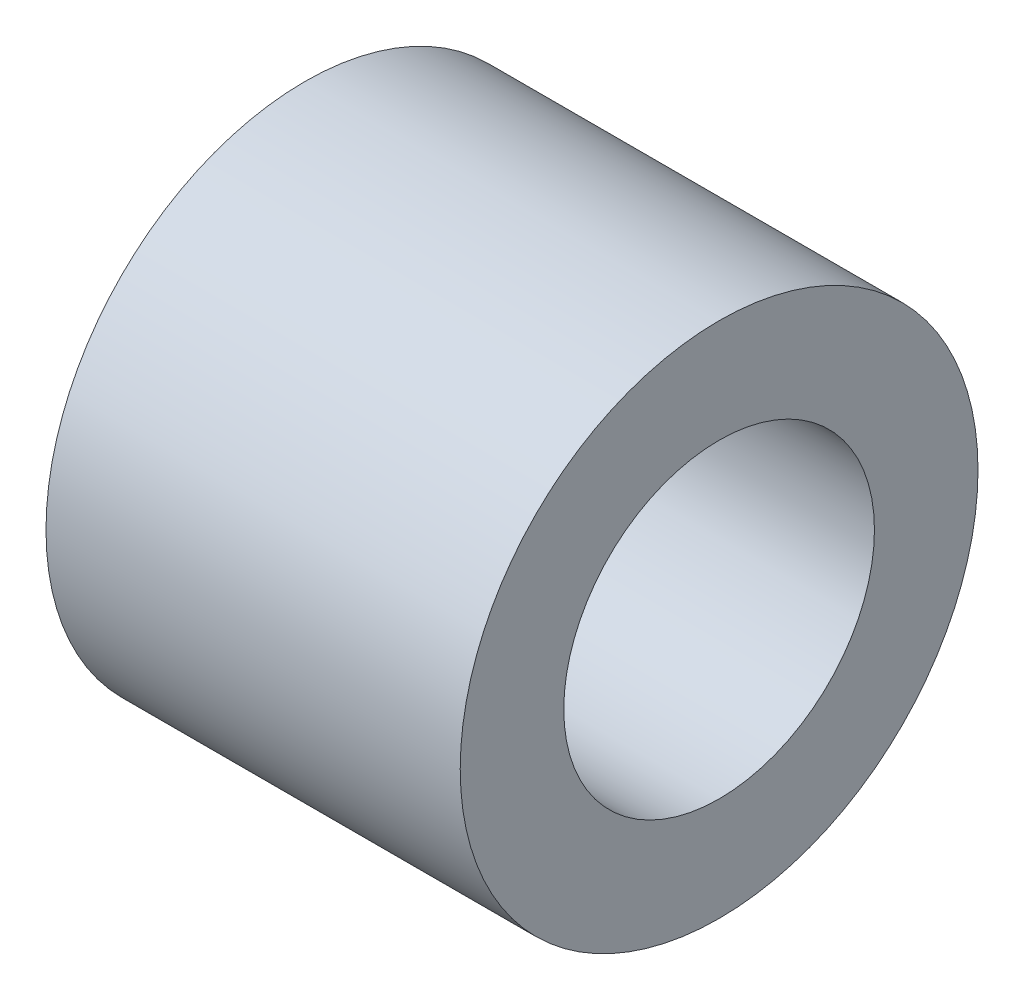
ISO-10303-21;
HEADER;
FILE_DESCRIPTION(('STEP AP214'),'2;1');
FILE_NAME('part.step','',(''),(''),'','','');
FILE_SCHEMA(('AUTOMOTIVE_DESIGN { 1 0 10303 214 1 1 1 1 }'));
ENDSEC;
DATA;
#1=APPLICATION_CONTEXT('core data for automotive mechanical design processes');
#2=APPLICATION_PROTOCOL_DEFINITION('international standard','automotive_design',2000,#1);
#3=PRODUCT_CONTEXT('',#1,'mechanical');
#4=PRODUCT('Part','Part','',(#3));
#5=PRODUCT_RELATED_PRODUCT_CATEGORY('part','',(#4));
#6=PRODUCT_DEFINITION_FORMATION('','',#4);
#7=PRODUCT_DEFINITION_CONTEXT('part definition',#1,'design');
#8=PRODUCT_DEFINITION('design','',#6,#7);
#9=PRODUCT_DEFINITION_SHAPE('','',#8);
#10=(LENGTH_UNIT() NAMED_UNIT(*) SI_UNIT(.MILLI.,.METRE.));
#11=(NAMED_UNIT(*) PLANE_ANGLE_UNIT() SI_UNIT($,.RADIAN.));
#12=(NAMED_UNIT(*) SI_UNIT($,.STERADIAN.) SOLID_ANGLE_UNIT());
#13=UNCERTAINTY_MEASURE_WITH_UNIT(LENGTH_MEASURE(1.E-05),#10,'distance_accuracy_value','');
#14=(GEOMETRIC_REPRESENTATION_CONTEXT(3) GLOBAL_UNCERTAINTY_ASSIGNED_CONTEXT((#13)) GLOBAL_UNIT_ASSIGNED_CONTEXT((#10,
#11,#12)) REPRESENTATION_CONTEXT('',''));
#15=CARTESIAN_POINT('',(0.,0.,0.));
#16=DIRECTION('',(0.,0.,1.));
#17=DIRECTION('',(1.,0.,0.));
#18=AXIS2_PLACEMENT_3D('',#15,#16,#17);
#19=CARTESIAN_POINT('',(8.,0.,0.));
#20=DIRECTION('',(-1.,0.,0.));
#21=DIRECTION('',(0.,0.,1.));
#22=AXIS2_PLACEMENT_3D('',#19,#20,#21);
#23=CYLINDRICAL_SURFACE('',#22,5.);
#24=CARTESIAN_POINT('',(8.,0.,0.));
#25=DIRECTION('',(1.,0.,0.));
#26=DIRECTION('',(0.,0.,-1.));
#27=AXIS2_PLACEMENT_3D('',#24,#25,#26);
#28=CIRCLE('',#27,5.);
#29=CARTESIAN_POINT('',(8.,0.,-5.));
#30=VERTEX_POINT('',#29);
#31=EDGE_CURVE('E10',#30,#30,#28,.T.);
#32=ORIENTED_EDGE('',*,*,#31,.F.);
#33=EDGE_LOOP('',(#32));
#34=FACE_BOUND('',#33,.T.);
#35=CARTESIAN_POINT('',(0.,0.,0.));
#36=DIRECTION('',(1.,0.,0.));
#37=DIRECTION('',(0.,0.,-1.));
#38=AXIS2_PLACEMENT_3D('',#35,#36,#37);
#39=CIRCLE('',#38,5.);
#40=CARTESIAN_POINT('',(0.,0.,-5.));
#41=VERTEX_POINT('',#40);
#42=EDGE_CURVE('E44',#41,#41,#39,.T.);
#43=ORIENTED_EDGE('',*,*,#42,.T.);
#44=EDGE_LOOP('',(#43));
#45=FACE_BOUND('',#44,.T.);
#46=ADVANCED_FACE('F41',(#34,#45),#23,.T.);
#47=CARTESIAN_POINT('',(8.,0.,0.));
#48=DIRECTION('',(1.,0.,0.));
#49=DIRECTION('',(0.,0.,-1.));
#50=AXIS2_PLACEMENT_3D('',#47,#48,#49);
#51=PLANE('',#50);
#52=CARTESIAN_POINT('',(8.,0.,0.));
#53=DIRECTION('',(1.,0.,0.));
#54=DIRECTION('',(0.,0.,-1.));
#55=AXIS2_PLACEMENT_3D('',#52,#53,#54);
#56=CIRCLE('',#55,3.);
#57=CARTESIAN_POINT('',(8.,0.,-3.));
#58=VERTEX_POINT('',#57);
#59=EDGE_CURVE('E55',#58,#58,#56,.T.);
#60=ORIENTED_EDGE('',*,*,#59,.F.);
#61=EDGE_LOOP('',(#60));
#62=FACE_BOUND('',#61,.T.);
#63=ORIENTED_EDGE('',*,*,#31,.T.);
#64=EDGE_LOOP('',(#63));
#65=FACE_BOUND('',#64,.T.);
#66=ADVANCED_FACE('F72',(#62,#65),#51,.T.);
#67=CARTESIAN_POINT('',(0.,0.,0.));
#68=DIRECTION('',(1.,0.,0.));
#69=DIRECTION('',(0.,0.,-1.));
#70=AXIS2_PLACEMENT_3D('',#67,#68,#69);
#71=PLANE('',#70);
#72=ORIENTED_EDGE('',*,*,#42,.F.);
#73=EDGE_LOOP('',(#72));
#74=FACE_BOUND('',#73,.T.);
#75=ADVANCED_FACE('F68',(#74),#71,.F.);
#76=CARTESIAN_POINT('',(2.,0.,0.));
#77=DIRECTION('',(1.,0.,0.));
#78=DIRECTION('',(0.,0.,-1.));
#79=AXIS2_PLACEMENT_3D('',#76,#77,#78);
#80=CYLINDRICAL_SURFACE('',#79,3.);
#81=CARTESIAN_POINT('',(2.,0.,0.));
#82=DIRECTION('',(1.,0.,0.));
#83=DIRECTION('',(0.,0.,-1.));
#84=AXIS2_PLACEMENT_3D('',#81,#82,#83);
#85=CIRCLE('',#84,3.);
#86=CARTESIAN_POINT('',(2.,0.,-3.));
#87=VERTEX_POINT('',#86);
#88=EDGE_CURVE('E53',#87,#87,#85,.T.);
#89=ORIENTED_EDGE('',*,*,#88,.F.);
#90=EDGE_LOOP('',(#89));
#91=FACE_BOUND('',#90,.T.);
#92=ORIENTED_EDGE('',*,*,#59,.T.);
#93=EDGE_LOOP('',(#92));
#94=FACE_BOUND('',#93,.T.);
#95=ADVANCED_FACE('F65',(#91,#94),#80,.F.);
#96=CARTESIAN_POINT('',(2.,0.,0.));
#97=DIRECTION('',(1.,0.,0.));
#98=DIRECTION('',(0.,0.,-1.));
#99=AXIS2_PLACEMENT_3D('',#96,#97,#98);
#100=PLANE('',#99);
#101=ORIENTED_EDGE('',*,*,#88,.T.);
#102=EDGE_LOOP('',(#101));
#103=FACE_BOUND('',#102,.T.);
#104=ADVANCED_FACE('F63',(#103),#100,.T.);
#105=CLOSED_SHELL('',(#46,#66,#75,#95,#104));
#106=MANIFOLD_SOLID_BREP('B2',#105);
#107=ADVANCED_BREP_SHAPE_REPRESENTATION('',(#18,#106),#14);
#108=SHAPE_DEFINITION_REPRESENTATION(#9,#107);
ENDSEC;
END-ISO-10303-21;
